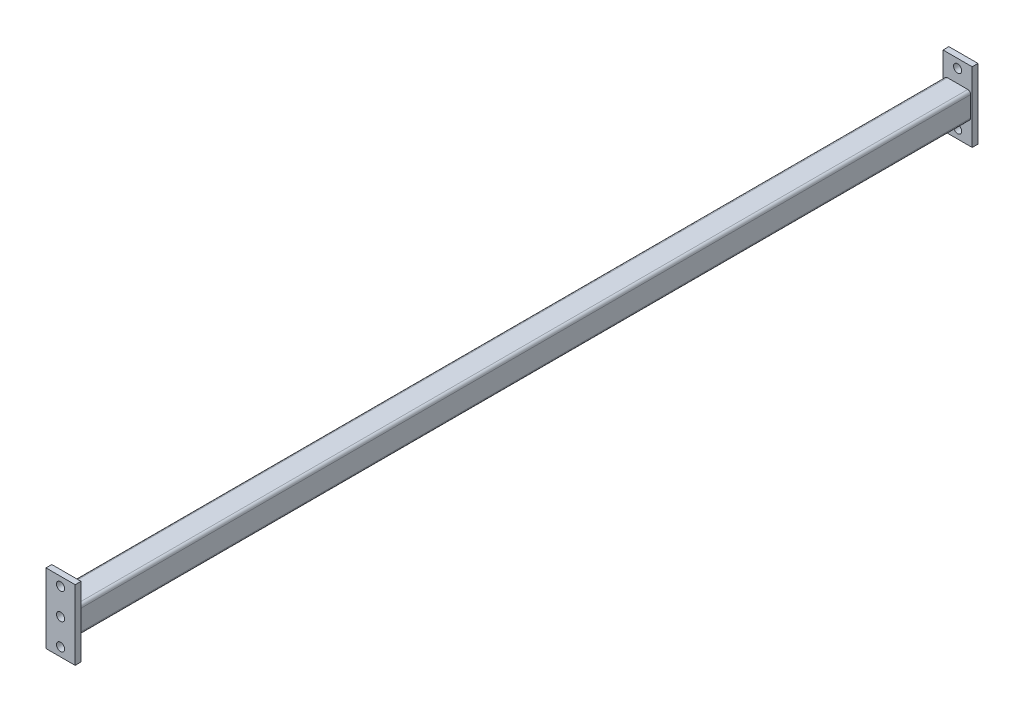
from build123d import *

# Parameters (mm, degrees)
ESQUISSE1_W          = 50
ESQUISSE1_H          = 120
ESQUISSE1_R          = 7
BASE_EXTRUSION_DEPTH = 10
ESQUISSE3_W          = 39
ESQUISSE3_H          = 39
BOSS_EXTRU_1_DEPTH   = 1530
ESQUISSE4_W          = 50
ESQUISSE4_H          = 120
ESQUISSE4_R          = 7
BOSS_EXTRU_2_DEPTH   = 10


with BuildPart() as part:
    # Esquisse1 → Base-Extrusion (new body)
    with BuildSketch(Plane.XY):
        Rectangle(ESQUISSE1_W, ESQUISSE1_H)
        with Locations((0, 45)):
            Circle(ESQUISSE1_R, mode=Mode.SUBTRACT)
        Circle(ESQUISSE1_R, mode=Mode.SUBTRACT)
        with Locations((0, -45)):
            Circle(ESQUISSE1_R, mode=Mode.SUBTRACT)
    extrude(amount=BASE_EXTRUSION_DEPTH)

    # Esquisse3 → Boss.-Extru.1 (add)
    with BuildSketch(Plane.XY.offset(10)):
        with BuildLine():
            Line((-17.5, 22.5), (17.5, 22.5))
            ThreePointArc((17.5, 22.5), (21.035533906, 21.035533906), (22.5, 17.5))
            Line((22.5, 17.5), (22.5, -17.5))
            ThreePointArc((22.5, -17.5), (21.035533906, -21.035533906), (17.5, -22.5))
            Line((17.5, -22.5), (-17.5, -22.5))
            ThreePointArc((-17.5, -22.5), (-21.035533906, -21.035533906), (-22.5, -17.5))
            Line((-22.5, -17.5), (-22.5, 17.5))
            ThreePointArc((-22.5, 17.5), (-21.035533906, 21.035533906), (-17.5, 22.5))
        make_face()
        Rectangle(ESQUISSE3_W, ESQUISSE3_H, mode=Mode.SUBTRACT)
    extrude(amount=BOSS_EXTRU_1_DEPTH)

    # Esquisse4 → Boss.-Extru.2 (add)
    with BuildSketch(Plane.XY.offset(1540)):
        Rectangle(ESQUISSE4_W, ESQUISSE4_H)
        Circle(ESQUISSE4_R, mode=Mode.SUBTRACT)
        with Locations((0, 45)):
            Circle(ESQUISSE4_R, mode=Mode.SUBTRACT)
        with Locations((0, -45)):
            Circle(ESQUISSE4_R, mode=Mode.SUBTRACT)
    extrude(amount=BOSS_EXTRU_2_DEPTH)


solid = part.part
